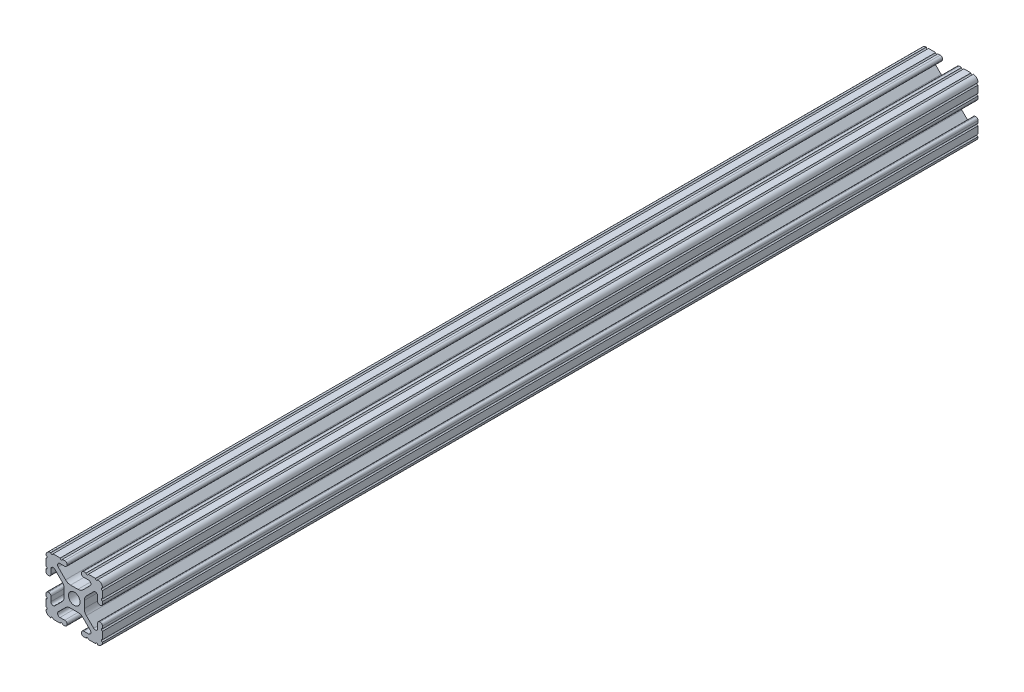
from build123d import *

# Parameters (mm, degrees)
SKETCH1_R           = 2.6035
BOSS_EXTRUDE1_DEPTH = 196.85


with BuildPart() as part:
    # Sketch1 → Boss-Extrude1 (new, symmetric)
    with BuildSketch(Plane.XY):
        with BuildLine():
            Line((-7.179650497, -8.645192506), (-3.952270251, -5.423690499))
            ThreePointArc((-3.952270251, -5.423690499), (-2.922936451, -4.736929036), (-1.709253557, -4.4958))
            Line((-1.709253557, -4.4958), (1.709253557, -4.4958))
            ThreePointArc((1.709253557, -4.4958), (2.922936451, -4.736929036), (3.952270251, -5.423690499))
            Line((3.952270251, -5.423690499), (7.179650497, -8.645192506))
            ThreePointArc((7.179650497, -8.645192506), (7.41473083, -9.822813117), (6.416408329, -10.4902))
            Line((6.416408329, -10.4902), (4.287512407, -10.4902))
            ThreePointArc((4.287512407, -10.4902), (3.54574862, -10.79744862), (3.2385, -11.539212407))
            Line((3.2385, -11.539212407), (3.2385, -11.650987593))
            ThreePointArc((3.2385, -11.650987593), (3.54574862, -12.39275138), (4.287512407, -12.7))
            Line((4.287512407, -12.7), (5.317126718, -12.7))
            ThreePointArc((5.317126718, -12.7), (5.825126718, -12.192), (6.333126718, -12.7))
            Line((6.333126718, -12.7), (9.550443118, -12.7))
            ThreePointArc((9.550443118, -12.7), (10.058366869, -12.192000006), (10.566443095, -12.699847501))
            ThreePointArc((10.566443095, -12.699847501), (12.082537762, -12.08250727), (12.699846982, -10.566399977))
            ThreePointArc((12.699846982, -10.566399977), (12.192000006, -10.058323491), (12.7, -9.5504))
            Line((12.7, -9.5504), (12.7, -6.3330836))
            ThreePointArc((12.7, -6.3330836), (12.192, -5.8250836), (12.7, -5.3170836))
            Line((12.7, -5.3170836), (12.7, -4.287469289))
            ThreePointArc((12.7, -4.287469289), (12.39275138, -3.545705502), (11.650987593, -3.238456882))
            Line((11.650987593, -3.238456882), (11.539212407, -3.238456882))
            ThreePointArc((11.539212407, -3.238456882), (10.79744862, -3.545705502), (10.4902, -4.287469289))
            Line((10.4902, -4.287469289), (10.4902, -6.402089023))
            ThreePointArc((10.4902, -6.402089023), (9.856505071, -7.351067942), (8.737131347, -7.129408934))
            Line((8.737131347, -7.129408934), (5.441005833, -3.840816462))
            ThreePointArc((5.441005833, -3.840816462), (4.750877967, -2.809883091), (4.5085, -1.593185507))
            Line((4.5085, -1.593185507), (4.5085, 1.593185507))
            ThreePointArc((4.5085, 1.593185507), (4.750877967, 2.809883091), (5.441005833, 3.840816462))
            Line((5.441005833, 3.840816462), (8.737131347, 7.129408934))
            ThreePointArc((8.737131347, 7.129408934), (9.856505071, 7.351067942), (10.4902, 6.402089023))
            Line((10.4902, 6.402089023), (10.4902, 4.287469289))
            ThreePointArc((10.4902, 4.287469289), (10.79744862, 3.545705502), (11.539212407, 3.238456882))
            Line((11.539212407, 3.238456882), (11.650987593, 3.238456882))
            ThreePointArc((11.650987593, 3.238456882), (12.39275138, 3.545705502), (12.7, 4.287469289))
            Line((12.7, 4.287469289), (12.7, 5.3170836))
            ThreePointArc((12.7, 5.3170836), (12.192, 5.8250836), (12.7, 6.3330836))
            Line((12.7, 6.3330836), (12.7, 9.5504))
            ThreePointArc((12.7, 9.5504), (12.192000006, 10.058323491), (12.699846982, 10.566399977))
            ThreePointArc((12.699846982, 10.566399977), (12.082537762, 12.08250727), (10.566443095, 12.699847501))
            ThreePointArc((10.566443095, 12.699847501), (10.058366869, 12.192000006), (9.550443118, 12.7))
            Line((9.550443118, 12.7), (6.333126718, 12.7))
            ThreePointArc((6.333126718, 12.7), (5.825126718, 12.192), (5.317126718, 12.7))
            Line((5.317126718, 12.7), (4.287512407, 12.7))
            ThreePointArc((4.287512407, 12.7), (3.54574862, 12.39275138), (3.2385, 11.650987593))
            Line((3.2385, 11.650987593), (3.2385, 11.539212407))
            ThreePointArc((3.2385, 11.539212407), (3.54574862, 10.79744862), (4.287512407, 10.4902))
            Line((4.287512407, 10.4902), (6.476788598, 10.4902))
            ThreePointArc((6.476788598, 10.4902), (7.432222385, 9.85140422), (7.207036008, 8.724370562))
            Line((7.207036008, 8.724370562), (3.898272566, 5.423169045))
            ThreePointArc((3.898272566, 5.423169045), (2.869120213, 4.736787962), (1.655778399, 4.4958))
            Line((1.655778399, 4.4958), (-1.655778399, 4.4958))
            ThreePointArc((-1.655778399, 4.4958), (-2.869120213, 4.736787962), (-3.898272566, 5.423169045))
            Line((-3.898272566, 5.423169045), (-7.207036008, 8.724370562))
            ThreePointArc((-7.207036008, 8.724370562), (-7.432222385, 9.85140422), (-6.476788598, 10.4902))
            Line((-6.476788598, 10.4902), (-4.287512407, 10.4902))
            ThreePointArc((-4.287512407, 10.4902), (-3.54574862, 10.79744862), (-3.2385, 11.539212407))
            Line((-3.2385, 11.539212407), (-3.2385, 11.650987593))
            ThreePointArc((-3.2385, 11.650987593), (-3.54574862, 12.39275138), (-4.287512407, 12.7))
            Line((-4.287512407, 12.7), (-5.317126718, 12.7))
            ThreePointArc((-5.317126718, 12.7), (-5.825126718, 12.192), (-6.333126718, 12.7))
            Line((-6.333126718, 12.7), (-9.550443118, 12.7))
            ThreePointArc((-9.550443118, 12.7), (-10.058366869, 12.192000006), (-10.566443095, 12.699847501))
            ThreePointArc((-10.566443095, 12.699847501), (-12.082537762, 12.08250727), (-12.699846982, 10.566399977))
            ThreePointArc((-12.699846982, 10.566399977), (-12.192000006, 10.058323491), (-12.7, 9.5504))
            Line((-12.7, 9.5504), (-12.7, 6.3330836))
            ThreePointArc((-12.7, 6.3330836), (-12.192, 5.8250836), (-12.7, 5.3170836))
            Line((-12.7, 5.3170836), (-12.7, 4.287469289))
            ThreePointArc((-12.7, 4.287469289), (-12.39275138, 3.545705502), (-11.650987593, 3.238456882))
            Line((-11.650987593, 3.238456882), (-11.539212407, 3.238456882))
            ThreePointArc((-11.539212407, 3.238456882), (-10.79744862, 3.545705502), (-10.4902, 4.287469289))
            Line((-10.4902, 4.287469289), (-10.4902, 6.402089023))
            ThreePointArc((-10.4902, 6.402089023), (-9.856505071, 7.351067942), (-8.737131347, 7.129408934))
            Line((-8.737131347, 7.129408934), (-5.441005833, 3.840816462))
            ThreePointArc((-5.441005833, 3.840816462), (-4.750877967, 2.809883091), (-4.5085, 1.593185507))
            Line((-4.5085, 1.593185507), (-4.5085, -1.593185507))
            ThreePointArc((-4.5085, -1.593185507), (-4.750877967, -2.809883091), (-5.441005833, -3.840816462))
            Line((-5.441005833, -3.840816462), (-8.737131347, -7.129408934))
            ThreePointArc((-8.737131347, -7.129408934), (-9.856505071, -7.351067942), (-10.4902, -6.402089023))
            Line((-10.4902, -6.402089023), (-10.4902, -4.287469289))
            ThreePointArc((-10.4902, -4.287469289), (-10.79744862, -3.545705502), (-11.539212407, -3.238456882))
            Line((-11.539212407, -3.238456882), (-11.650987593, -3.238456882))
            ThreePointArc((-11.650987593, -3.238456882), (-12.39275138, -3.545705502), (-12.7, -4.287469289))
            Line((-12.7, -4.287469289), (-12.7, -5.3170836))
            ThreePointArc((-12.7, -5.3170836), (-12.192, -5.8250836), (-12.7, -6.3330836))
            Line((-12.7, -6.3330836), (-12.7, -9.5504))
            ThreePointArc((-12.7, -9.5504), (-12.192000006, -10.058323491), (-12.699846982, -10.566399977))
            ThreePointArc((-12.699846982, -10.566399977), (-12.082537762, -12.08250727), (-10.566443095, -12.699847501))
            ThreePointArc((-10.566443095, -12.699847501), (-10.058366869, -12.192000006), (-9.550443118, -12.7))
            Line((-9.550443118, -12.7), (-6.333126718, -12.7))
            ThreePointArc((-6.333126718, -12.7), (-5.825126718, -12.192), (-5.317126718, -12.7))
            Line((-5.317126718, -12.7), (-4.287512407, -12.7))
            ThreePointArc((-4.287512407, -12.7), (-3.54574862, -12.39275138), (-3.2385, -11.650987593))
            Line((-3.2385, -11.650987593), (-3.2385, -11.539212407))
            ThreePointArc((-3.2385, -11.539212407), (-3.54574862, -10.79744862), (-4.287512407, -10.4902))
            Line((-4.287512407, -10.4902), (-6.416408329, -10.4902))
            ThreePointArc((-6.416408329, -10.4902), (-7.41473083, -9.822813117), (-7.179650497, -8.645192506))
        make_face()
        Circle(SKETCH1_R, mode=Mode.SUBTRACT)
    extrude(amount=BOSS_EXTRUDE1_DEPTH, both=True)


solid = part.part
